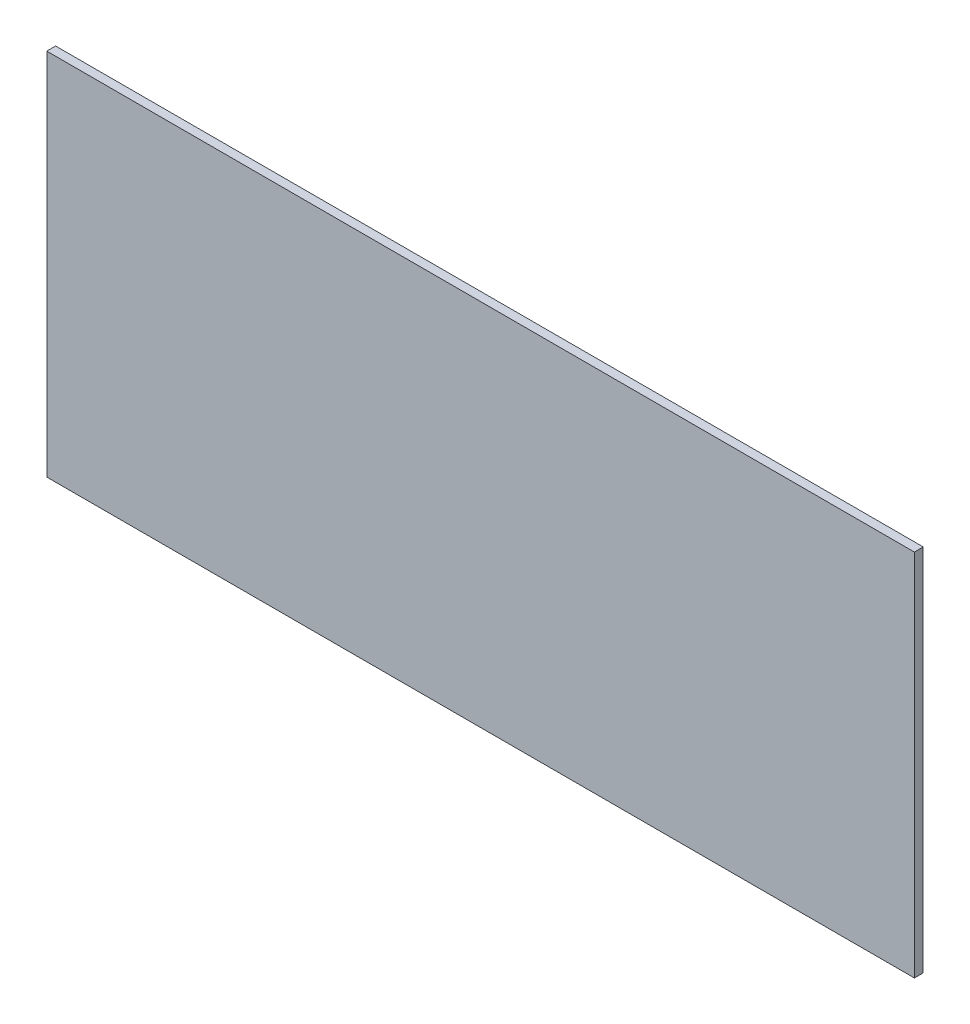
ISO-10303-21;
HEADER;
FILE_DESCRIPTION(('STEP AP214'),'2;1');
FILE_NAME('part.step','',(''),(''),'','','');
FILE_SCHEMA(('AUTOMOTIVE_DESIGN { 1 0 10303 214 1 1 1 1 }'));
ENDSEC;
DATA;
#1=APPLICATION_CONTEXT('core data for automotive mechanical design processes');
#2=APPLICATION_PROTOCOL_DEFINITION('international standard','automotive_design',2000,#1);
#3=PRODUCT_CONTEXT('',#1,'mechanical');
#4=PRODUCT('Part','Part','',(#3));
#5=PRODUCT_RELATED_PRODUCT_CATEGORY('part','',(#4));
#6=PRODUCT_DEFINITION_FORMATION('','',#4);
#7=PRODUCT_DEFINITION_CONTEXT('part definition',#1,'design');
#8=PRODUCT_DEFINITION('design','',#6,#7);
#9=PRODUCT_DEFINITION_SHAPE('','',#8);
#10=(LENGTH_UNIT() NAMED_UNIT(*) SI_UNIT(.MILLI.,.METRE.));
#11=(NAMED_UNIT(*) PLANE_ANGLE_UNIT() SI_UNIT($,.RADIAN.));
#12=(NAMED_UNIT(*) SI_UNIT($,.STERADIAN.) SOLID_ANGLE_UNIT());
#13=UNCERTAINTY_MEASURE_WITH_UNIT(LENGTH_MEASURE(1.E-05),#10,'distance_accuracy_value','');
#14=(GEOMETRIC_REPRESENTATION_CONTEXT(3) GLOBAL_UNCERTAINTY_ASSIGNED_CONTEXT((#13)) GLOBAL_UNIT_ASSIGNED_CONTEXT((#10,
#11,#12)) REPRESENTATION_CONTEXT('',''));
#15=CARTESIAN_POINT('',(0.,0.,0.));
#16=DIRECTION('',(0.,0.,1.));
#17=DIRECTION('',(1.,0.,0.));
#18=AXIS2_PLACEMENT_3D('',#15,#16,#17);
#19=CARTESIAN_POINT('',(294.,125.,6.));
#20=DIRECTION('',(-1.,0.,0.));
#21=DIRECTION('',(0.,-1.,0.));
#22=AXIS2_PLACEMENT_3D('',#19,#20,#21);
#23=PLANE('',#22);
#24=DIRECTION('',(0.,1.,0.));
#25=VECTOR('',#24,1.);
#26=CARTESIAN_POINT('',(294.,125.,0.));
#27=LINE('',#26,#25);
#28=CARTESIAN_POINT('',(294.,-125.,0.));
#29=VERTEX_POINT('',#28);
#30=CARTESIAN_POINT('',(294.,125.,0.));
#31=VERTEX_POINT('',#30);
#32=EDGE_CURVE('E113',#29,#31,#27,.T.);
#33=ORIENTED_EDGE('',*,*,#32,.T.);
#34=DIRECTION('',(0.,0.,-1.));
#35=VECTOR('',#34,1.);
#36=CARTESIAN_POINT('',(294.,125.,6.));
#37=LINE('',#36,#35);
#38=CARTESIAN_POINT('',(294.,125.,6.));
#39=VERTEX_POINT('',#38);
#40=EDGE_CURVE('E11',#39,#31,#37,.T.);
#41=ORIENTED_EDGE('',*,*,#40,.F.);
#42=DIRECTION('',(0.,1.,0.));
#43=VECTOR('',#42,1.);
#44=CARTESIAN_POINT('',(294.,125.,6.));
#45=LINE('',#44,#43);
#46=CARTESIAN_POINT('',(294.,-125.,6.));
#47=VERTEX_POINT('',#46);
#48=EDGE_CURVE('E97',#47,#39,#45,.T.);
#49=ORIENTED_EDGE('',*,*,#48,.F.);
#50=DIRECTION('',(0.,0.,-1.));
#51=VECTOR('',#50,1.);
#52=CARTESIAN_POINT('',(294.,-125.,6.));
#53=LINE('',#52,#51);
#54=EDGE_CURVE('E109',#47,#29,#53,.T.);
#55=ORIENTED_EDGE('',*,*,#54,.T.);
#56=EDGE_LOOP('',(#33,#41,#49,#55));
#57=FACE_BOUND('',#56,.T.);
#58=ADVANCED_FACE('F45',(#57),#23,.F.);
#59=CARTESIAN_POINT('',(-294.,125.,6.));
#60=DIRECTION('',(0.,-1.,0.));
#61=DIRECTION('',(0.,0.,-1.));
#62=AXIS2_PLACEMENT_3D('',#59,#60,#61);
#63=PLANE('',#62);
#64=DIRECTION('',(-1.,0.,0.));
#65=VECTOR('',#64,1.);
#66=CARTESIAN_POINT('',(-294.,125.,0.));
#67=LINE('',#66,#65);
#68=CARTESIAN_POINT('',(-294.,125.,0.));
#69=VERTEX_POINT('',#68);
#70=EDGE_CURVE('E102',#31,#69,#67,.T.);
#71=ORIENTED_EDGE('',*,*,#70,.T.);
#72=DIRECTION('',(0.,0.,-1.));
#73=VECTOR('',#72,1.);
#74=CARTESIAN_POINT('',(-294.,125.,6.));
#75=LINE('',#74,#73);
#76=CARTESIAN_POINT('',(-294.,125.,6.));
#77=VERTEX_POINT('',#76);
#78=EDGE_CURVE('E54',#77,#69,#75,.T.);
#79=ORIENTED_EDGE('',*,*,#78,.F.);
#80=DIRECTION('',(-1.,0.,0.));
#81=VECTOR('',#80,1.);
#82=CARTESIAN_POINT('',(-294.,125.,6.));
#83=LINE('',#82,#81);
#84=EDGE_CURVE('E92',#39,#77,#83,.T.);
#85=ORIENTED_EDGE('',*,*,#84,.F.);
#86=ORIENTED_EDGE('',*,*,#40,.T.);
#87=EDGE_LOOP('',(#71,#79,#85,#86));
#88=FACE_BOUND('',#87,.T.);
#89=ADVANCED_FACE('F101',(#88),#63,.F.);
#90=CARTESIAN_POINT('',(-294.,125.,6.));
#91=DIRECTION('',(1.,0.,0.));
#92=DIRECTION('',(0.,1.,0.));
#93=AXIS2_PLACEMENT_3D('',#90,#91,#92);
#94=PLANE('',#93);
#95=DIRECTION('',(0.,-1.,0.));
#96=VECTOR('',#95,1.);
#97=CARTESIAN_POINT('',(-294.,125.,0.));
#98=LINE('',#97,#96);
#99=CARTESIAN_POINT('',(-294.,-125.,0.));
#100=VERTEX_POINT('',#99);
#101=EDGE_CURVE('E79',#69,#100,#98,.T.);
#102=ORIENTED_EDGE('',*,*,#101,.T.);
#103=DIRECTION('',(0.,0.,-1.));
#104=VECTOR('',#103,1.);
#105=CARTESIAN_POINT('',(-294.,-125.,6.));
#106=LINE('',#105,#104);
#107=CARTESIAN_POINT('',(-294.,-125.,6.));
#108=VERTEX_POINT('',#107);
#109=EDGE_CURVE('E104',#108,#100,#106,.T.);
#110=ORIENTED_EDGE('',*,*,#109,.F.);
#111=DIRECTION('',(0.,-1.,0.));
#112=VECTOR('',#111,1.);
#113=CARTESIAN_POINT('',(-294.,125.,6.));
#114=LINE('',#113,#112);
#115=EDGE_CURVE('E95',#77,#108,#114,.T.);
#116=ORIENTED_EDGE('',*,*,#115,.F.);
#117=ORIENTED_EDGE('',*,*,#78,.T.);
#118=EDGE_LOOP('',(#102,#110,#116,#117));
#119=FACE_BOUND('',#118,.T.);
#120=ADVANCED_FACE('F105',(#119),#94,.F.);
#121=CARTESIAN_POINT('',(-294.,-125.,6.));
#122=DIRECTION('',(0.,1.,0.));
#123=DIRECTION('',(0.,0.,1.));
#124=AXIS2_PLACEMENT_3D('',#121,#122,#123);
#125=PLANE('',#124);
#126=DIRECTION('',(1.,0.,0.));
#127=VECTOR('',#126,1.);
#128=CARTESIAN_POINT('',(-294.,-125.,0.));
#129=LINE('',#128,#127);
#130=EDGE_CURVE('E85',#100,#29,#129,.T.);
#131=ORIENTED_EDGE('',*,*,#130,.T.);
#132=ORIENTED_EDGE('',*,*,#54,.F.);
#133=DIRECTION('',(1.,0.,0.));
#134=VECTOR('',#133,1.);
#135=CARTESIAN_POINT('',(-294.,-125.,6.));
#136=LINE('',#135,#134);
#137=EDGE_CURVE('E62',#108,#47,#136,.T.);
#138=ORIENTED_EDGE('',*,*,#137,.F.);
#139=ORIENTED_EDGE('',*,*,#109,.T.);
#140=EDGE_LOOP('',(#131,#132,#138,#139));
#141=FACE_BOUND('',#140,.T.);
#142=ADVANCED_FACE('F126',(#141),#125,.F.);
#143=CARTESIAN_POINT('',(0.,0.,6.));
#144=DIRECTION('',(0.,0.,1.));
#145=DIRECTION('',(1.,0.,0.));
#146=AXIS2_PLACEMENT_3D('',#143,#144,#145);
#147=PLANE('',#146);
#148=ORIENTED_EDGE('',*,*,#48,.T.);
#149=ORIENTED_EDGE('',*,*,#84,.T.);
#150=ORIENTED_EDGE('',*,*,#115,.T.);
#151=ORIENTED_EDGE('',*,*,#137,.T.);
#152=EDGE_LOOP('',(#148,#149,#150,#151));
#153=FACE_BOUND('',#152,.T.);
#154=ADVANCED_FACE('F93',(#153),#147,.T.);
#155=CARTESIAN_POINT('',(0.,0.,0.));
#156=DIRECTION('',(0.,0.,1.));
#157=DIRECTION('',(1.,0.,0.));
#158=AXIS2_PLACEMENT_3D('',#155,#156,#157);
#159=PLANE('',#158);
#160=ORIENTED_EDGE('',*,*,#32,.F.);
#161=ORIENTED_EDGE('',*,*,#130,.F.);
#162=ORIENTED_EDGE('',*,*,#101,.F.);
#163=ORIENTED_EDGE('',*,*,#70,.F.);
#164=EDGE_LOOP('',(#160,#161,#162,#163));
#165=FACE_BOUND('',#164,.T.);
#166=ADVANCED_FACE('F129',(#165),#159,.F.);
#167=CLOSED_SHELL('',(#58,#89,#120,#142,#154,#166));
#168=MANIFOLD_SOLID_BREP('B2',#167);
#169=ADVANCED_BREP_SHAPE_REPRESENTATION('',(#18,#168),#14);
#170=SHAPE_DEFINITION_REPRESENTATION(#9,#169);
ENDSEC;
END-ISO-10303-21;
